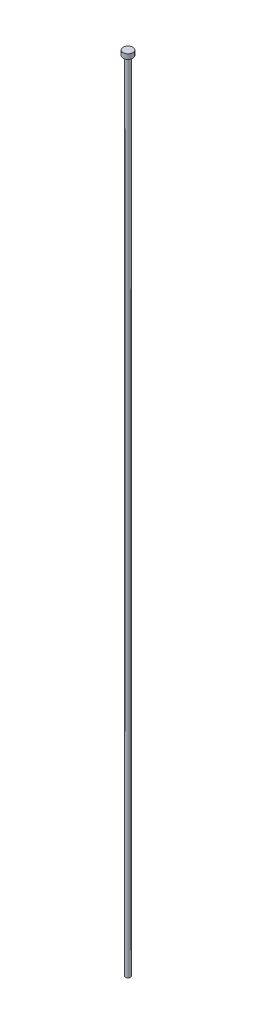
from build123d import *

# Parameters (mm, degrees)
PINDIA_R            = 1.5
LENGTH_DEPTH        = 500
HEADDIA_R           = 3
HEADTHICKNESS_DEPTH = 3
FILLET1_R           = 0.3


with BuildPart() as part:
    # PinDia → Length (new body)
    with BuildSketch(Plane(origin=(0, 0, 0), x_dir=(1, 0, 0), z_dir=(0, 1, 0))):
        with Locations(Location((0, 0, 0), (0, 0, 270))):
            Circle(PINDIA_R)
    extrude(amount=-LENGTH_DEPTH)

    # HeadDia → HeadThickness (add)
    with BuildSketch(Plane(origin=(0, 0, 0), x_dir=(1, 0, 0), z_dir=(0, 1, 0))):
        with Locations(Location((0, 0, 0), (0, 0, 270))):
            Circle(HEADDIA_R)
    extrude(amount=-HEADTHICKNESS_DEPTH)

    # Fillet1
    fillet1_edges = [part.edges().sort_by_distance(p)[0] for p in [
        (0, -3, -1.5),
    ]]
    fillet(fillet1_edges, radius=FILLET1_R)


solid = part.part
